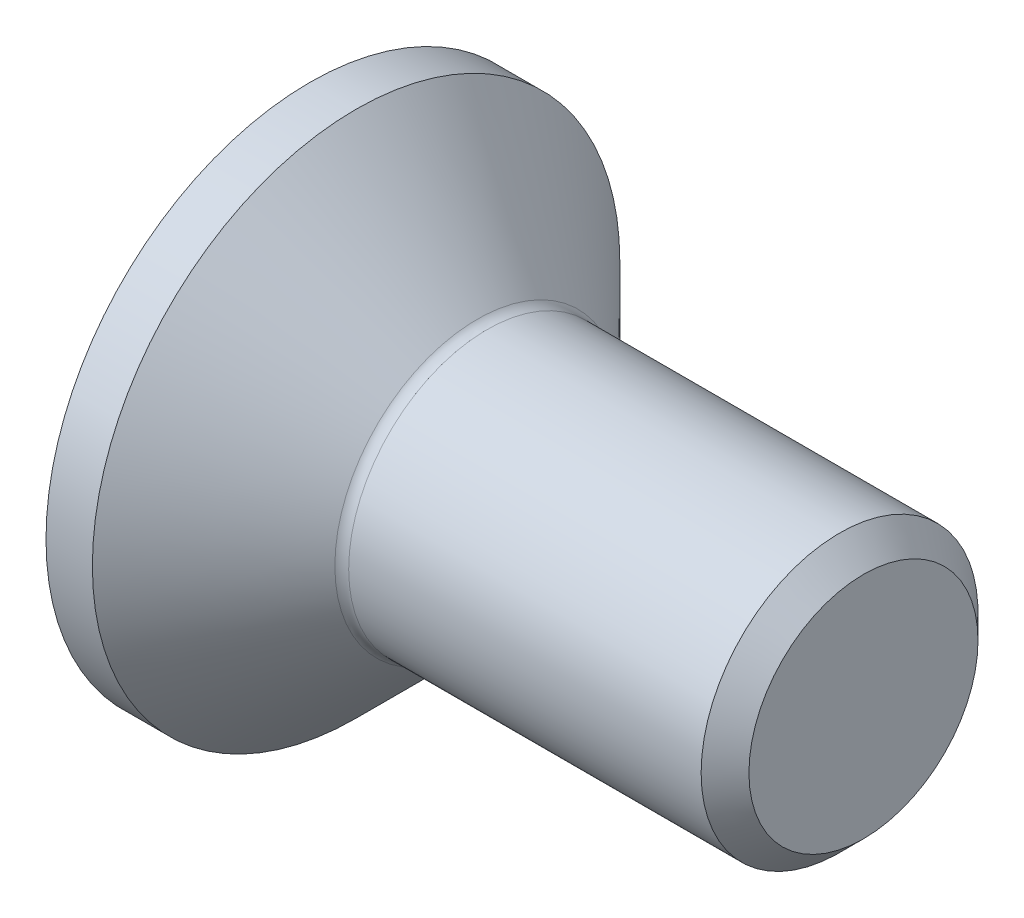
ISO-10303-21;
HEADER;
FILE_DESCRIPTION(('STEP AP214'),'2;1');
FILE_NAME('part.step','',(''),(''),'','','');
FILE_SCHEMA(('AUTOMOTIVE_DESIGN { 1 0 10303 214 1 1 1 1 }'));
ENDSEC;
DATA;
#1=APPLICATION_CONTEXT('core data for automotive mechanical design processes');
#2=APPLICATION_PROTOCOL_DEFINITION('international standard','automotive_design',2000,#1);
#3=PRODUCT_CONTEXT('',#1,'mechanical');
#4=PRODUCT('Part','Part','',(#3));
#5=PRODUCT_RELATED_PRODUCT_CATEGORY('part','',(#4));
#6=PRODUCT_DEFINITION_FORMATION('','',#4);
#7=PRODUCT_DEFINITION_CONTEXT('part definition',#1,'design');
#8=PRODUCT_DEFINITION('design','',#6,#7);
#9=PRODUCT_DEFINITION_SHAPE('','',#8);
#10=(LENGTH_UNIT() NAMED_UNIT(*) SI_UNIT(.MILLI.,.METRE.));
#11=(NAMED_UNIT(*) PLANE_ANGLE_UNIT() SI_UNIT($,.RADIAN.));
#12=(NAMED_UNIT(*) SI_UNIT($,.STERADIAN.) SOLID_ANGLE_UNIT());
#13=UNCERTAINTY_MEASURE_WITH_UNIT(LENGTH_MEASURE(1.E-05),#10,'distance_accuracy_value','');
#14=(GEOMETRIC_REPRESENTATION_CONTEXT(3) GLOBAL_UNCERTAINTY_ASSIGNED_CONTEXT((#13)) GLOBAL_UNIT_ASSIGNED_CONTEXT((#10,
#11,#12)) REPRESENTATION_CONTEXT('',''));
#15=CARTESIAN_POINT('',(0.,0.,0.));
#16=DIRECTION('',(0.,0.,1.));
#17=DIRECTION('',(1.,0.,0.));
#18=AXIS2_PLACEMENT_3D('',#15,#16,#17);
#19=CARTESIAN_POINT('',(0.,0.,0.));
#20=DIRECTION('',(-1.,0.,0.));
#21=DIRECTION('',(0.,0.,1.));
#22=AXIS2_PLACEMENT_3D('',#19,#20,#21);
#23=PLANE('',#22);
#24=CARTESIAN_POINT('',(0.,0.,0.));
#25=DIRECTION('',(-1.,0.,0.));
#26=DIRECTION('',(0.,0.,1.));
#27=AXIS2_PLACEMENT_3D('',#24,#25,#26);
#28=CIRCLE('',#27,7.62);
#29=CARTESIAN_POINT('',(0.,0.,7.62));
#30=VERTEX_POINT('',#29);
#31=EDGE_CURVE('E156',#30,#30,#28,.T.);
#32=ORIENTED_EDGE('',*,*,#31,.T.);
#33=EDGE_LOOP('',(#32));
#34=FACE_BOUND('',#33,.T.);
#35=DIRECTION('',(0.,-0.5,-0.866025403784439));
#36=VECTOR('',#35,1.);
#37=CARTESIAN_POINT('',(0.,-1.44337567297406,2.5));
#38=LINE('',#37,#36);
#39=CARTESIAN_POINT('',(0.,-1.44337567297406,2.5));
#40=VERTEX_POINT('',#39);
#41=CARTESIAN_POINT('',(0.,-2.88675134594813,0.));
#42=VERTEX_POINT('',#41);
#43=EDGE_CURVE('E118',#40,#42,#38,.T.);
#44=ORIENTED_EDGE('',*,*,#43,.T.);
#45=DIRECTION('',(0.,0.5,-0.866025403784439));
#46=VECTOR('',#45,1.);
#47=CARTESIAN_POINT('',(0.,-2.88675134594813,0.));
#48=LINE('',#47,#46);
#49=CARTESIAN_POINT('',(0.,-1.44337567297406,-2.5));
#50=VERTEX_POINT('',#49);
#51=EDGE_CURVE('E48',#42,#50,#48,.T.);
#52=ORIENTED_EDGE('',*,*,#51,.T.);
#53=DIRECTION('',(0.,1.,0.));
#54=VECTOR('',#53,1.);
#55=CARTESIAN_POINT('',(0.,-1.44337567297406,-2.5));
#56=LINE('',#55,#54);
#57=CARTESIAN_POINT('',(0.,1.44337567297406,-2.5));
#58=VERTEX_POINT('',#57);
#59=EDGE_CURVE('E133',#50,#58,#56,.T.);
#60=ORIENTED_EDGE('',*,*,#59,.T.);
#61=DIRECTION('',(0.,0.5,0.866025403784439));
#62=VECTOR('',#61,1.);
#63=CARTESIAN_POINT('',(0.,1.44337567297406,-2.5));
#64=LINE('',#63,#62);
#65=CARTESIAN_POINT('',(0.,2.88675134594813,0.));
#66=VERTEX_POINT('',#65);
#67=EDGE_CURVE('E269',#58,#66,#64,.T.);
#68=ORIENTED_EDGE('',*,*,#67,.T.);
#69=DIRECTION('',(0.,-0.5,0.866025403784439));
#70=VECTOR('',#69,1.);
#71=CARTESIAN_POINT('',(0.,2.88675134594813,0.));
#72=LINE('',#71,#70);
#73=CARTESIAN_POINT('',(0.,1.44337567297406,2.5));
#74=VERTEX_POINT('',#73);
#75=EDGE_CURVE('E272',#66,#74,#72,.T.);
#76=ORIENTED_EDGE('',*,*,#75,.T.);
#77=DIRECTION('',(0.,-1.,0.));
#78=VECTOR('',#77,1.);
#79=CARTESIAN_POINT('',(0.,1.44337567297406,2.5));
#80=LINE('',#79,#78);
#81=EDGE_CURVE('E275',#74,#40,#80,.T.);
#82=ORIENTED_EDGE('',*,*,#81,.T.);
#83=EDGE_LOOP('',(#44,#52,#60,#68,#76,#82));
#84=FACE_BOUND('',#83,.T.);
#85=ADVANCED_FACE('F33',(#34,#84),#23,.T.);
#86=CARTESIAN_POINT('',(0.,0.,0.));
#87=DIRECTION('',(-1.,0.,0.));
#88=DIRECTION('',(0.,0.,1.));
#89=AXIS2_PLACEMENT_3D('',#86,#87,#88);
#90=CYLINDRICAL_SURFACE('',#89,7.62);
#91=CARTESIAN_POINT('',(1.34000000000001,0.,0.));
#92=DIRECTION('',(-1.,0.,0.));
#93=DIRECTION('',(0.,0.,1.));
#94=AXIS2_PLACEMENT_3D('',#91,#92,#93);
#95=CIRCLE('',#94,7.62);
#96=CARTESIAN_POINT('',(1.34000000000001,0.,7.62));
#97=VERTEX_POINT('',#96);
#98=EDGE_CURVE('E153',#97,#97,#95,.T.);
#99=ORIENTED_EDGE('',*,*,#98,.T.);
#100=EDGE_LOOP('',(#99));
#101=FACE_BOUND('',#100,.T.);
#102=ORIENTED_EDGE('',*,*,#31,.F.);
#103=EDGE_LOOP('',(#102));
#104=FACE_BOUND('',#103,.T.);
#105=ADVANCED_FACE('F177',(#101,#104),#90,.T.);
#106=CARTESIAN_POINT('',(1.34000000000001,0.,0.));
#107=DIRECTION('',(-1.,0.,0.));
#108=DIRECTION('',(0.,0.,1.));
#109=AXIS2_PLACEMENT_3D('',#106,#107,#108);
#110=CONICAL_SURFACE('',#109,7.62,0.78539816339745);
#111=CARTESIAN_POINT('',(4.84284271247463,0.,0.));
#112=DIRECTION('',(-1.,0.,0.));
#113=DIRECTION('',(0.,0.,1.));
#114=AXIS2_PLACEMENT_3D('',#111,#112,#113);
#115=CIRCLE('',#114,4.11715728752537);
#116=CARTESIAN_POINT('',(4.84284271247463,0.,4.11715728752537));
#117=VERTEX_POINT('',#116);
#118=EDGE_CURVE('E41',#117,#117,#115,.T.);
#119=ORIENTED_EDGE('',*,*,#118,.T.);
#120=EDGE_LOOP('',(#119));
#121=FACE_BOUND('',#120,.T.);
#122=ORIENTED_EDGE('',*,*,#98,.F.);
#123=EDGE_LOOP('',(#122));
#124=FACE_BOUND('',#123,.T.);
#125=ADVANCED_FACE('F161',(#121,#124),#110,.T.);
#126=CARTESIAN_POINT('',(0.,0.,0.));
#127=DIRECTION('',(-1.,0.,0.));
#128=DIRECTION('',(0.,0.,1.));
#129=AXIS2_PLACEMENT_3D('',#126,#127,#128);
#130=CYLINDRICAL_SURFACE('',#129,3.99999999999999);
#131=CARTESIAN_POINT('',(5.12568542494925,0.,0.));
#132=DIRECTION('',(-1.,0.,0.));
#133=DIRECTION('',(0.,0.,1.));
#134=AXIS2_PLACEMENT_3D('',#131,#132,#133);
#135=CIRCLE('',#134,3.99999999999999);
#136=CARTESIAN_POINT('',(5.12568542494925,0.,3.99999999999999));
#137=VERTEX_POINT('',#136);
#138=EDGE_CURVE('E11',#137,#137,#135,.F.);
#139=ORIENTED_EDGE('',*,*,#138,.T.);
#140=EDGE_LOOP('',(#139));
#141=FACE_BOUND('',#140,.T.);
#142=CARTESIAN_POINT('',(15.3095,0.,0.));
#143=DIRECTION('',(-1.,0.,0.));
#144=DIRECTION('',(0.,0.,1.));
#145=AXIS2_PLACEMENT_3D('',#142,#143,#144);
#146=CIRCLE('',#145,3.99999999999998);
#147=CARTESIAN_POINT('',(15.3095,0.,3.99999999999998));
#148=VERTEX_POINT('',#147);
#149=EDGE_CURVE('E150',#148,#148,#146,.T.);
#150=ORIENTED_EDGE('',*,*,#149,.T.);
#151=EDGE_LOOP('',(#150));
#152=FACE_BOUND('',#151,.T.);
#153=ADVANCED_FACE('F188',(#141,#152),#130,.T.);
#154=CARTESIAN_POINT('',(16.,0.,0.));
#155=DIRECTION('',(-1.,0.,0.));
#156=DIRECTION('',(0.,0.,1.));
#157=AXIS2_PLACEMENT_3D('',#154,#155,#156);
#158=CONICAL_SURFACE('',#157,3.3095,0.785398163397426);
#159=ORIENTED_EDGE('',*,*,#149,.F.);
#160=EDGE_LOOP('',(#159));
#161=FACE_BOUND('',#160,.T.);
#162=CARTESIAN_POINT('',(16.,0.,0.));
#163=DIRECTION('',(-1.,0.,0.));
#164=DIRECTION('',(0.,0.,1.));
#165=AXIS2_PLACEMENT_3D('',#162,#163,#164);
#166=CIRCLE('',#165,3.3095);
#167=CARTESIAN_POINT('',(16.,0.,3.3095));
#168=VERTEX_POINT('',#167);
#169=EDGE_CURVE('E146',#168,#168,#166,.T.);
#170=ORIENTED_EDGE('',*,*,#169,.T.);
#171=EDGE_LOOP('',(#170));
#172=FACE_BOUND('',#171,.T.);
#173=ADVANCED_FACE('F172',(#161,#172),#158,.T.);
#174=CARTESIAN_POINT('',(16.,3.3095,0.));
#175=DIRECTION('',(1.,0.,0.));
#176=DIRECTION('',(0.,0.,-1.));
#177=AXIS2_PLACEMENT_3D('',#174,#175,#176);
#178=PLANE('',#177);
#179=ORIENTED_EDGE('',*,*,#169,.F.);
#180=EDGE_LOOP('',(#179));
#181=FACE_BOUND('',#180,.T.);
#182=ADVANCED_FACE('F165',(#181),#178,.T.);
#183=CARTESIAN_POINT('',(5.12568542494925,0.,0.));
#184=DIRECTION('',(-1.,0.,0.));
#185=DIRECTION('',(0.,0.,1.));
#186=AXIS2_PLACEMENT_3D('',#183,#184,#185);
#187=TOROIDAL_SURFACE('',#186,4.39999999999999,0.4);
#188=ORIENTED_EDGE('',*,*,#138,.F.);
#189=EDGE_LOOP('',(#188));
#190=FACE_BOUND('',#189,.T.);
#191=ORIENTED_EDGE('',*,*,#118,.F.);
#192=EDGE_LOOP('',(#191));
#193=FACE_BOUND('',#192,.T.);
#194=ADVANCED_FACE('F35',(#190,#193),#187,.F.);
#195=CARTESIAN_POINT('',(3.,-2.88675134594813,0.));
#196=DIRECTION('',(0.,0.866025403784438,0.5));
#197=DIRECTION('',(0.,-0.5,0.866025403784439));
#198=AXIS2_PLACEMENT_3D('',#195,#196,#197);
#199=PLANE('',#198);
#200=ORIENTED_EDGE('',*,*,#51,.F.);
#201=DIRECTION('',(-1.,0.,0.));
#202=VECTOR('',#201,1.);
#203=CARTESIAN_POINT('',(3.,-2.88675134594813,0.));
#204=LINE('',#203,#202);
#205=CARTESIAN_POINT('',(3.,-2.88675134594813,0.));
#206=VERTEX_POINT('',#205);
#207=EDGE_CURVE('E266',#206,#42,#204,.T.);
#208=ORIENTED_EDGE('',*,*,#207,.F.);
#209=DIRECTION('',(0.,0.5,-0.866025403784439));
#210=VECTOR('',#209,1.);
#211=CARTESIAN_POINT('',(3.,-2.88675134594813,0.));
#212=LINE('',#211,#210);
#213=CARTESIAN_POINT('',(3.,-2.1650635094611,-1.25));
#214=VERTEX_POINT('',#213);
#215=EDGE_CURVE('E115',#206,#214,#212,.T.);
#216=ORIENTED_EDGE('',*,*,#215,.T.);
#217=CARTESIAN_POINT('',(3.,-1.44337567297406,-2.5));
#218=VERTEX_POINT('',#217);
#219=EDGE_CURVE('E109',#214,#218,#212,.T.);
#220=ORIENTED_EDGE('',*,*,#219,.T.);
#221=DIRECTION('',(-1.,0.,0.));
#222=VECTOR('',#221,1.);
#223=CARTESIAN_POINT('',(3.,-1.44337567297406,-2.5));
#224=LINE('',#223,#222);
#225=EDGE_CURVE('E113',#218,#50,#224,.T.);
#226=ORIENTED_EDGE('',*,*,#225,.T.);
#227=EDGE_LOOP('',(#200,#208,#216,#220,#226));
#228=FACE_BOUND('',#227,.T.);
#229=ADVANCED_FACE('F111',(#228),#199,.T.);
#230=CARTESIAN_POINT('',(3.,-1.44337567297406,-2.5));
#231=DIRECTION('',(0.,0.,1.));
#232=DIRECTION('',(1.,0.,0.));
#233=AXIS2_PLACEMENT_3D('',#230,#231,#232);
#234=PLANE('',#233);
#235=ORIENTED_EDGE('',*,*,#59,.F.);
#236=ORIENTED_EDGE('',*,*,#225,.F.);
#237=DIRECTION('',(0.,1.,0.));
#238=VECTOR('',#237,1.);
#239=CARTESIAN_POINT('',(3.,-1.44337567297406,-2.5));
#240=LINE('',#239,#238);
#241=CARTESIAN_POINT('',(3.,0.,-2.5));
#242=VERTEX_POINT('',#241);
#243=EDGE_CURVE('E121',#218,#242,#240,.T.);
#244=ORIENTED_EDGE('',*,*,#243,.T.);
#245=CARTESIAN_POINT('',(3.,1.44337567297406,-2.5));
#246=VERTEX_POINT('',#245);
#247=EDGE_CURVE('E128',#242,#246,#240,.T.);
#248=ORIENTED_EDGE('',*,*,#247,.T.);
#249=DIRECTION('',(-1.,0.,0.));
#250=VECTOR('',#249,1.);
#251=CARTESIAN_POINT('',(3.,1.44337567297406,-2.5));
#252=LINE('',#251,#250);
#253=EDGE_CURVE('E135',#246,#58,#252,.T.);
#254=ORIENTED_EDGE('',*,*,#253,.T.);
#255=EDGE_LOOP('',(#235,#236,#244,#248,#254));
#256=FACE_BOUND('',#255,.T.);
#257=ADVANCED_FACE('F130',(#256),#234,.T.);
#258=CARTESIAN_POINT('',(3.,1.44337567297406,-2.5));
#259=DIRECTION('',(0.,-0.866025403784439,0.5));
#260=DIRECTION('',(0.,-0.5,-0.866025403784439));
#261=AXIS2_PLACEMENT_3D('',#258,#259,#260);
#262=PLANE('',#261);
#263=ORIENTED_EDGE('',*,*,#67,.F.);
#264=ORIENTED_EDGE('',*,*,#253,.F.);
#265=DIRECTION('',(0.,0.5,0.866025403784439));
#266=VECTOR('',#265,1.);
#267=CARTESIAN_POINT('',(3.,1.44337567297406,-2.5));
#268=LINE('',#267,#266);
#269=CARTESIAN_POINT('',(3.,2.1650635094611,-1.25));
#270=VERTEX_POINT('',#269);
#271=EDGE_CURVE('E258',#246,#270,#268,.T.);
#272=ORIENTED_EDGE('',*,*,#271,.T.);
#273=CARTESIAN_POINT('',(3.,2.88675134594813,0.));
#274=VERTEX_POINT('',#273);
#275=EDGE_CURVE('E127',#270,#274,#268,.T.);
#276=ORIENTED_EDGE('',*,*,#275,.T.);
#277=DIRECTION('',(-1.,0.,0.));
#278=VECTOR('',#277,1.);
#279=CARTESIAN_POINT('',(3.,2.88675134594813,0.));
#280=LINE('',#279,#278);
#281=EDGE_CURVE('E141',#274,#66,#280,.T.);
#282=ORIENTED_EDGE('',*,*,#281,.T.);
#283=EDGE_LOOP('',(#263,#264,#272,#276,#282));
#284=FACE_BOUND('',#283,.T.);
#285=ADVANCED_FACE('F202',(#284),#262,.T.);
#286=CARTESIAN_POINT('',(3.,2.88675134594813,0.));
#287=DIRECTION('',(0.,-0.866025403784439,-0.5));
#288=DIRECTION('',(0.,0.5,-0.866025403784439));
#289=AXIS2_PLACEMENT_3D('',#286,#287,#288);
#290=PLANE('',#289);
#291=ORIENTED_EDGE('',*,*,#75,.F.);
#292=ORIENTED_EDGE('',*,*,#281,.F.);
#293=DIRECTION('',(0.,-0.5,0.866025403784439));
#294=VECTOR('',#293,1.);
#295=CARTESIAN_POINT('',(3.,2.88675134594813,0.));
#296=LINE('',#295,#294);
#297=CARTESIAN_POINT('',(3.,2.1650635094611,1.25));
#298=VERTEX_POINT('',#297);
#299=EDGE_CURVE('E56',#274,#298,#296,.T.);
#300=ORIENTED_EDGE('',*,*,#299,.T.);
#301=CARTESIAN_POINT('',(3.,1.44337567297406,2.5));
#302=VERTEX_POINT('',#301);
#303=EDGE_CURVE('E237',#298,#302,#296,.T.);
#304=ORIENTED_EDGE('',*,*,#303,.T.);
#305=DIRECTION('',(-1.,0.,0.));
#306=VECTOR('',#305,1.);
#307=CARTESIAN_POINT('',(3.,1.44337567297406,2.5));
#308=LINE('',#307,#306);
#309=EDGE_CURVE('E251',#302,#74,#308,.T.);
#310=ORIENTED_EDGE('',*,*,#309,.T.);
#311=EDGE_LOOP('',(#291,#292,#300,#304,#310));
#312=FACE_BOUND('',#311,.T.);
#313=ADVANCED_FACE('F205',(#312),#290,.T.);
#314=CARTESIAN_POINT('',(3.,1.44337567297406,2.5));
#315=DIRECTION('',(0.,0.,-1.));
#316=DIRECTION('',(-1.,0.,0.));
#317=AXIS2_PLACEMENT_3D('',#314,#315,#316);
#318=PLANE('',#317);
#319=ORIENTED_EDGE('',*,*,#81,.F.);
#320=ORIENTED_EDGE('',*,*,#309,.F.);
#321=DIRECTION('',(0.,-1.,0.));
#322=VECTOR('',#321,1.);
#323=CARTESIAN_POINT('',(3.,1.44337567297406,2.5));
#324=LINE('',#323,#322);
#325=CARTESIAN_POINT('',(3.,0.,2.5));
#326=VERTEX_POINT('',#325);
#327=EDGE_CURVE('E236',#302,#326,#324,.T.);
#328=ORIENTED_EDGE('',*,*,#327,.T.);
#329=CARTESIAN_POINT('',(3.,-1.44337567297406,2.5));
#330=VERTEX_POINT('',#329);
#331=EDGE_CURVE('E242',#326,#330,#324,.T.);
#332=ORIENTED_EDGE('',*,*,#331,.T.);
#333=DIRECTION('',(-1.,0.,0.));
#334=VECTOR('',#333,1.);
#335=CARTESIAN_POINT('',(3.,-1.44337567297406,2.5));
#336=LINE('',#335,#334);
#337=EDGE_CURVE('E281',#330,#40,#336,.T.);
#338=ORIENTED_EDGE('',*,*,#337,.T.);
#339=EDGE_LOOP('',(#319,#320,#328,#332,#338));
#340=FACE_BOUND('',#339,.T.);
#341=ADVANCED_FACE('F209',(#340),#318,.T.);
#342=CARTESIAN_POINT('',(3.,-1.44337567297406,2.5));
#343=DIRECTION('',(0.,0.866025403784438,-0.5));
#344=DIRECTION('',(0.,0.5,0.866025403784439));
#345=AXIS2_PLACEMENT_3D('',#342,#343,#344);
#346=PLANE('',#345);
#347=ORIENTED_EDGE('',*,*,#43,.F.);
#348=ORIENTED_EDGE('',*,*,#337,.F.);
#349=DIRECTION('',(0.,-0.5,-0.866025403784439));
#350=VECTOR('',#349,1.);
#351=CARTESIAN_POINT('',(3.,-1.44337567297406,2.5));
#352=LINE('',#351,#350);
#353=CARTESIAN_POINT('',(3.,-2.1650635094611,1.25));
#354=VERTEX_POINT('',#353);
#355=EDGE_CURVE('E245',#330,#354,#352,.T.);
#356=ORIENTED_EDGE('',*,*,#355,.T.);
#357=EDGE_CURVE('E252',#354,#206,#352,.T.);
#358=ORIENTED_EDGE('',*,*,#357,.T.);
#359=ORIENTED_EDGE('',*,*,#207,.T.);
#360=EDGE_LOOP('',(#347,#348,#356,#358,#359));
#361=FACE_BOUND('',#360,.T.);
#362=ADVANCED_FACE('F212',(#361),#346,.T.);
#363=CARTESIAN_POINT('',(3.,-2.88675134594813,0.));
#364=DIRECTION('',(-1.,0.,0.));
#365=DIRECTION('',(0.,0.,1.));
#366=AXIS2_PLACEMENT_3D('',#363,#364,#365);
#367=PLANE('',#366);
#368=CARTESIAN_POINT('',(3.,0.,0.));
#369=DIRECTION('',(-1.,0.,0.));
#370=DIRECTION('',(0.,0.,1.));
#371=AXIS2_PLACEMENT_3D('',#368,#369,#370);
#372=CIRCLE('',#371,2.5);
#373=EDGE_CURVE('E134',#354,#326,#372,.T.);
#374=ORIENTED_EDGE('',*,*,#373,.F.);
#375=ORIENTED_EDGE('',*,*,#355,.F.);
#376=ORIENTED_EDGE('',*,*,#331,.F.);
#377=EDGE_LOOP('',(#374,#375,#376));
#378=FACE_BOUND('',#377,.T.);
#379=ADVANCED_FACE('F216',(#378),#367,.T.);
#380=EDGE_CURVE('E138',#214,#354,#372,.T.);
#381=ORIENTED_EDGE('',*,*,#380,.F.);
#382=ORIENTED_EDGE('',*,*,#215,.F.);
#383=ORIENTED_EDGE('',*,*,#357,.F.);
#384=EDGE_LOOP('',(#381,#382,#383));
#385=FACE_BOUND('',#384,.T.);
#386=ADVANCED_FACE('F219',(#385),#367,.T.);
#387=EDGE_CURVE('E123',#242,#214,#372,.T.);
#388=ORIENTED_EDGE('',*,*,#387,.F.);
#389=ORIENTED_EDGE('',*,*,#243,.F.);
#390=ORIENTED_EDGE('',*,*,#219,.F.);
#391=EDGE_LOOP('',(#388,#389,#390));
#392=FACE_BOUND('',#391,.T.);
#393=ADVANCED_FACE('F122',(#392),#367,.T.);
#394=EDGE_CURVE('E254',#270,#242,#372,.T.);
#395=ORIENTED_EDGE('',*,*,#394,.F.);
#396=ORIENTED_EDGE('',*,*,#271,.F.);
#397=ORIENTED_EDGE('',*,*,#247,.F.);
#398=EDGE_LOOP('',(#395,#396,#397));
#399=FACE_BOUND('',#398,.T.);
#400=ADVANCED_FACE('F231',(#399),#367,.T.);
#401=EDGE_CURVE('E147',#298,#270,#372,.T.);
#402=ORIENTED_EDGE('',*,*,#401,.F.);
#403=ORIENTED_EDGE('',*,*,#299,.F.);
#404=ORIENTED_EDGE('',*,*,#275,.F.);
#405=EDGE_LOOP('',(#402,#403,#404));
#406=FACE_BOUND('',#405,.T.);
#407=ADVANCED_FACE('F226',(#406),#367,.T.);
#408=EDGE_CURVE('E140',#326,#298,#372,.T.);
#409=ORIENTED_EDGE('',*,*,#408,.F.);
#410=ORIENTED_EDGE('',*,*,#327,.F.);
#411=ORIENTED_EDGE('',*,*,#303,.F.);
#412=EDGE_LOOP('',(#409,#410,#411));
#413=FACE_BOUND('',#412,.T.);
#414=ADVANCED_FACE('F197',(#413),#367,.T.);
#415=CARTESIAN_POINT('',(3.,0.,0.));
#416=DIRECTION('',(-1.,0.,0.));
#417=DIRECTION('',(0.,0.,1.));
#418=AXIS2_PLACEMENT_3D('',#415,#416,#417);
#419=CONICAL_SURFACE('',#418,2.5,1.04719755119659);
#420=CARTESIAN_POINT('',(4.44337567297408,0.,0.));
#421=VERTEX_POINT('',#420);
#422=VERTEX_LOOP('',#421);
#423=FACE_BOUND('',#422,.T.);
#424=ORIENTED_EDGE('',*,*,#408,.T.);
#425=ORIENTED_EDGE('',*,*,#401,.T.);
#426=ORIENTED_EDGE('',*,*,#394,.T.);
#427=ORIENTED_EDGE('',*,*,#387,.T.);
#428=ORIENTED_EDGE('',*,*,#380,.T.);
#429=ORIENTED_EDGE('',*,*,#373,.T.);
#430=EDGE_LOOP('',(#424,#425,#426,#427,#428,#429));
#431=FACE_BOUND('',#430,.T.);
#432=ADVANCED_FACE('F195',(#423,#431),#419,.F.);
#433=CLOSED_SHELL('',(#85,#105,#125,#153,#173,#182,#194,#229,#257,#285,#313,#341,#362,#379,#386,
#393,#400,#407,#414,#432));
#434=MANIFOLD_SOLID_BREP('B2',#433);
#435=ADVANCED_BREP_SHAPE_REPRESENTATION('',(#18,#434),#14);
#436=SHAPE_DEFINITION_REPRESENTATION(#9,#435);
ENDSEC;
END-ISO-10303-21;
